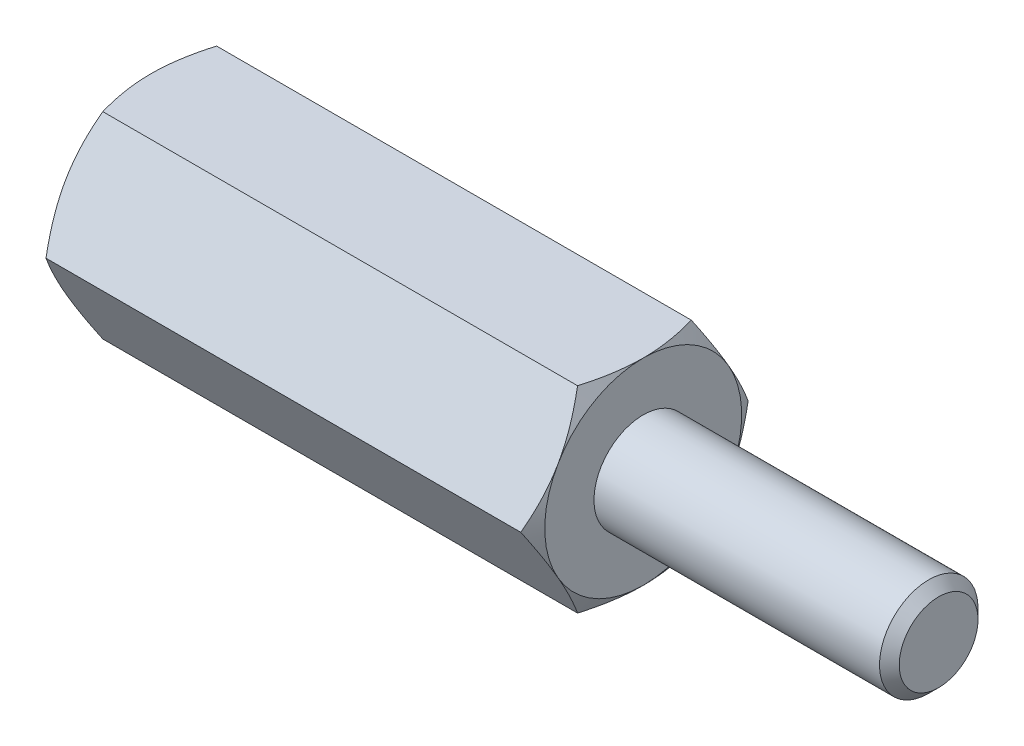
from build123d import *

# Parameters (mm, degrees)
EXTRUDE2_DEPTH = 5
SKETCH3_R      = 0.8
EXTRUDE3_DEPTH = 5
SKETCH5_R      = 1
EXTRUDE4_DEPTH = 6
CHAMFER1_SIZE  = 0.2


with BuildPart() as part:
    # Sketch1 → Extrude2 (new, symmetric)
    with BuildSketch(Plane(origin=(0, 0, 0), x_dir=(0, 0, -1), z_dir=(1, 0, 0))):
        Polygon((1.154700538, 2), (-1.154700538, 2), (-2.309401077, 0), (-1.154700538, -2), (1.154700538, -2), (2.309401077, 0), align=None)
    extrude(amount=EXTRUDE2_DEPTH, both=True)

    # Sketch2 → Cut-Revolve1 (revolve, cut)
    with BuildSketch(Plane.XY):
        with BuildLine():
            Line((-5, 2), (-3.5, 4.598076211))
            ThreePointArc((-3.5, 4.598076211), (-3.98810136, 5.776457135), (-5, 5))
            Line((-5, 5), (-5, 2))
        make_face()
    cut_revolve1 = revolve(axis=Axis((0, 0, 0), (1, 0, 0)), mode=Mode.SUBTRACT)

    # Mirror1: Cut-Revolve1 across plane
    add(cut_revolve1.mirror(Plane(origin=(0, 0, 0), x_dir=(0, 0, 1), z_dir=(1, 0, 0))), mode=Mode.SUBTRACT)

    # Sketch3 → Extrude3 (cut)
    with BuildSketch(Plane.ZY.offset(5)):
        Circle(SKETCH3_R)
    extrude(amount=-EXTRUDE3_DEPTH, mode=Mode.SUBTRACT)

    # Sketch4 → Cut-Revolve2 (revolve, cut)
    with BuildSketch(Plane.XY, mode=Mode.PRIVATE) as cut_revolve2_sk:
        Polygon((0, 0), (0, 0.8), (0.461880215, 0), align=None)
    revolve(cut_revolve2_sk.sketch.rotate(Axis((0.461880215, 0, 0), (-1, 0, 0)), 270), axis=Axis((0.461880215, 0, 0), (-1, 0, 0)), mode=Mode.SUBTRACT)

    # Sketch5 → Extrude4 (add)
    with BuildSketch(Plane(origin=(5, 0, 0), x_dir=(0, 0, -1), z_dir=(1, 0, 0))):
        Circle(SKETCH5_R)
    extrude(amount=EXTRUDE4_DEPTH)

    # Chamfer1
    chamfer1_edges = [part.edges().sort_by_distance(p)[0] for p in [
        (11, 0, 1),
    ]]
    chamfer(chamfer1_edges, length=CHAMFER1_SIZE)


solid = part.part
